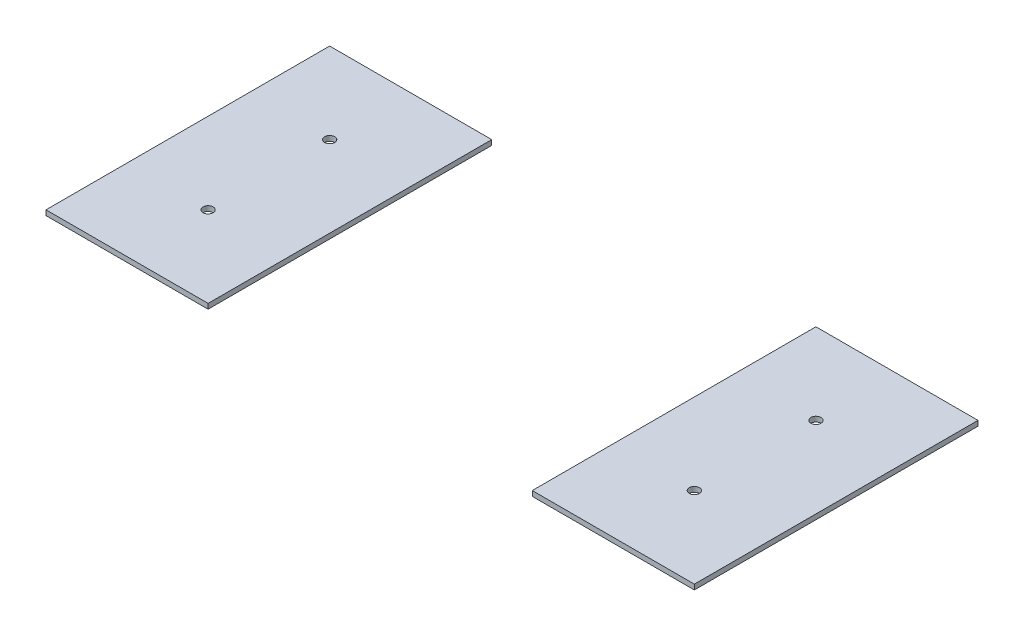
from build123d import *

# Parameters (mm, degrees)
SKETCH2_W           = 406.4
SKETCH2_H           = 3.175
BOSS_EXTRUDE1_DEPTH = 177.8
CUT_EXTRUDE2_REACH  = 272.024
SKETCH4_W           = 406.4
SKETCH4_H           = 88.9
SKETCH5_R           = 3.175
CUT_EXTRUDE3_DEPTH  = 222.818688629
SKETCH6_W           = 203.2
SKETCH6_H           = 177.8
CUT_EXTRUDE4_DEPTH  = 222.818688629


with BuildPart() as part:
    # Sketch2 → Boss-Extrude1 (new, symmetric)
    with BuildSketch(Plane.XY):
        with Locations((0, 1.5875)):
            Rectangle(SKETCH2_W, SKETCH2_H)
    extrude(amount=BOSS_EXTRUDE1_DEPTH, both=True)

    # Sketch4 → Cut-Extrude2 (cut, up to next)
    with BuildSketch(Plane(origin=(0, 3.175, 0), x_dir=(1, 0, 0), z_dir=(0, 1, 0)), mode=Mode.PRIVATE) as cut_extrude2_sk1:
        with Locations((0, 133.35)):
            Rectangle(SKETCH4_W, SKETCH4_H)
    cut_extrude2_tool1 = extrude(cut_extrude2_sk1.sketch, amount=-CUT_EXTRUDE2_REACH, mode=Mode.PRIVATE) & part.part
    # Sketch4 → Cut-Extrude2 (cut, up to next)
    with BuildSketch(Plane(origin=(0, 3.175, 0), x_dir=(1, 0, 0), z_dir=(0, 1, 0)), mode=Mode.PRIVATE) as cut_extrude2_sk2:
        with Locations((0, -133.35)):
            Rectangle(SKETCH4_W, SKETCH4_H)
    cut_extrude2_tool2 = extrude(cut_extrude2_sk2.sketch, amount=-CUT_EXTRUDE2_REACH, mode=Mode.PRIVATE) & part.part
    add(cut_extrude2_tool1.solids().sort_by_distance((0, 3.175, -133.35))[0], mode=Mode.SUBTRACT)
    add(cut_extrude2_tool2.solids().sort_by_distance((0, 3.175, 133.35))[0], mode=Mode.SUBTRACT)

    # Sketch5 → Cut-Extrude3 (cut, through all)
    with BuildSketch(Plane(origin=(0, 3.175, 0), x_dir=(1, 0, 0), z_dir=(0, 1, 0))):
        with Locations(Location((-152.4, 38.1, 0), (0, 0, 180))):
            Circle(SKETCH5_R)
        with Locations(Location((-152.4, -38.1, 0), (0, 0, 180))):
            Circle(SKETCH5_R)
        with Locations((152.4, -38.1)):
            Circle(SKETCH5_R)
        with Locations((152.4, 38.1)):
            Circle(SKETCH5_R)
    extrude(amount=-CUT_EXTRUDE3_DEPTH, mode=Mode.SUBTRACT)

    # Sketch6 → Cut-Extrude4 (cut, through all)
    with BuildSketch(Plane(origin=(0, 3.175, 0), x_dir=(1, 0, 0), z_dir=(0, 1, 0))):
        Rectangle(SKETCH6_W, SKETCH6_H)
    extrude(amount=-CUT_EXTRUDE4_DEPTH, mode=Mode.SUBTRACT)


with BuildPart() as cut_extrude4_piece_1:
    # of the separate pieces the step leaves, piece 1, a body of its own (cut_extrude4_pieces)
    add(part.part.solids().sort_by_distance((101.6, 0, 88.9))[0])


with BuildPart() as cut_extrude4_piece_2:
    # of the separate pieces the step leaves, piece 2, a body of its own (cut_extrude4_pieces)
    add(part.part.solids().sort_by_distance((-203.2, 0, 88.9))[0])


solid = Compound([cut_extrude4_piece_1.part, cut_extrude4_piece_2.part])
